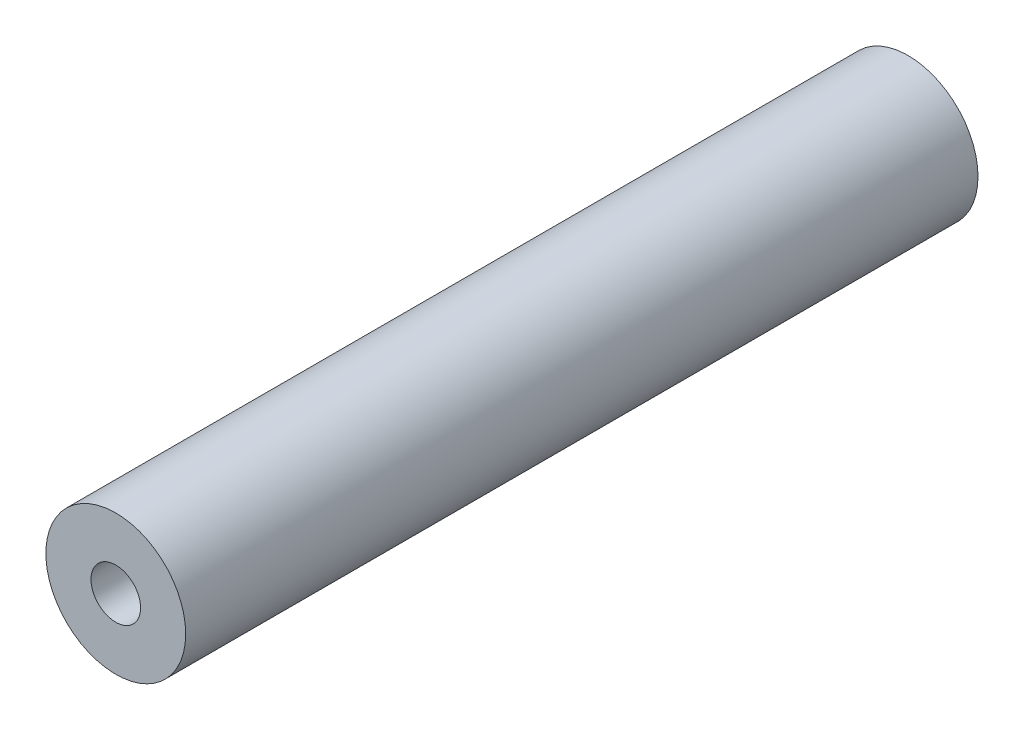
from build123d import *

# Parameters (mm, degrees)
SKETCH1_R               = 9.525
BOSS_EXTRUDE1_DEPTH     = 107.95
F_1_4_CLEARANCE_HOLE1_D = 6.7564


with BuildPart() as part:
    # Sketch1 → Boss-Extrude1 (new body)
    with BuildSketch(Plane.XY):
        Circle(SKETCH1_R)
    extrude(amount=BOSS_EXTRUDE1_DEPTH)

    # 1_4 Clearance Hole1 (through all)
    with Locations(Plane.XY.offset(107.95)):
        with Locations((0, 0)):
            Hole(F_1_4_CLEARANCE_HOLE1_D / 2)


solid = part.part
